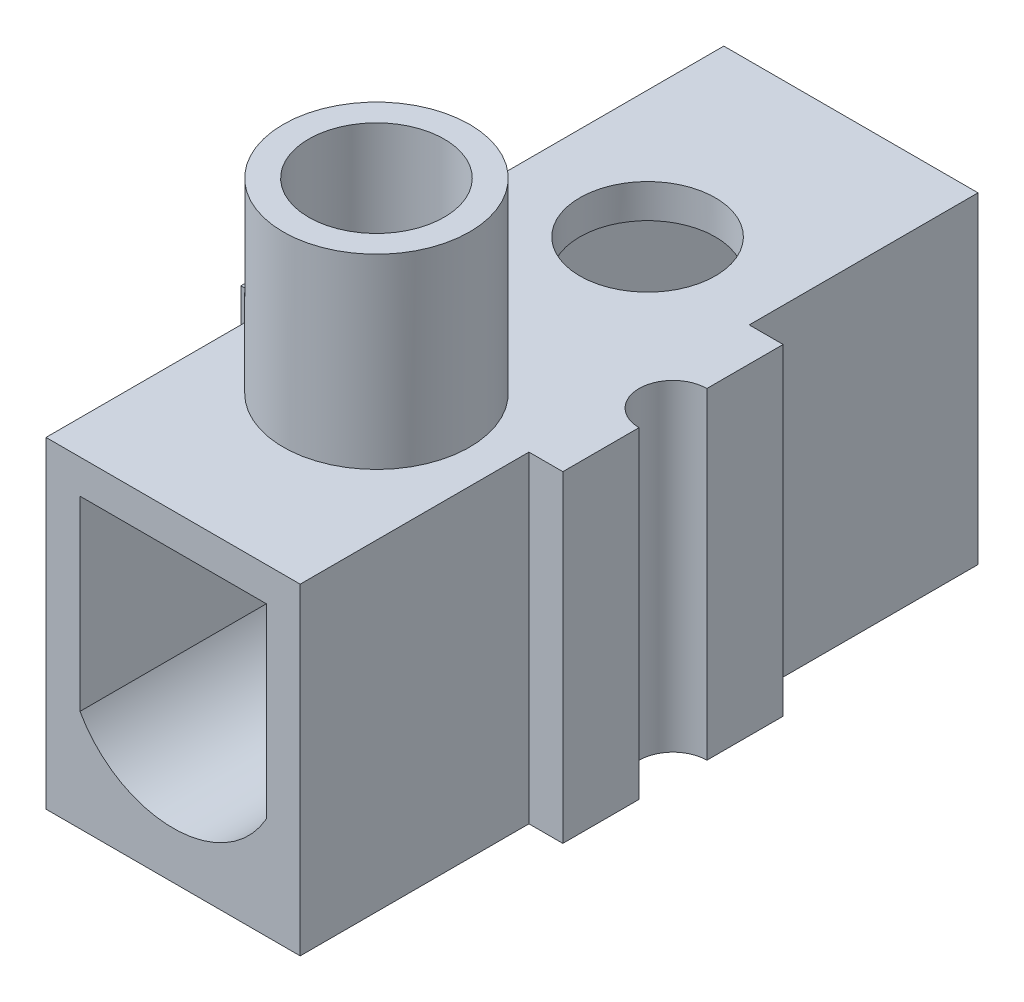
from build123d import *

# Parameters (mm, degrees)
ESQUISSE1_W             = 7.5
ESQUISSE1_H             = 9.5
EXTRUSION1_DEPTH        = 10
ESQUISSE2_W             = 6.5
ESQUISSE2_H             = 9.5
EXTRUSION2_DEPTH        = 1
ENL_V_MAT_EXTRU_1_DEPTH = 15.588094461
ESQUISSE4_R             = 2
ENL_V_MAT_EXTRU_2_DEPTH = 3
EXTRUSION3_START        = 5.5
ESQUISSE5_R             = 2.75
ESQUISSE5_R_2           = 2
EXTRUSION3_DEPTH        = 5.5


with BuildPart() as part:
    # Esquisse1 → Extrusion1 (new, symmetric)
    with BuildSketch(Plane.XY):
        with Locations((0, -4.75)):
            Rectangle(ESQUISSE1_W, ESQUISSE1_H)
        with BuildLine():
            Line((-2.747406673, -1), (2.75, -1))
            Line((2.75, -1), (2.75, -6.5))
            ThreePointArc((2.75, -6.5), (0.001296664, -8.111451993), (-2.747406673, -6.5))
            Line((-2.747406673, -6.5), (-2.747406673, -1))
        make_face(mode=Mode.SUBTRACT)
    extrude(amount=EXTRUSION1_DEPTH, both=True)

    # Esquisse2 → Extrusion2 (add)
    with BuildSketch(Plane(origin=(3.75, 0, 0), x_dir=(0, 0, -1), z_dir=(1, 0, 0))):
        with Locations((0, -4.75)):
            Rectangle(ESQUISSE2_W, ESQUISSE2_H)
    extrusion2 = extrude(amount=EXTRUSION2_DEPTH)

    # Sym_trie1: Extrusion2 across plane
    add(extrusion2.mirror(Plane(origin=(0, 0, 0), x_dir=(0, 0, 1), z_dir=(1, 0, 0))))

    # Esquisse3 → Enl_v. mat.-Extru.1 (cut, through all)
    with BuildSketch(Plane(origin=(0, 0, 0), x_dir=(-1, 0, 0), z_dir=(0, 1, 0))):
        with BuildLine():
            Line((-4.75, 1), (-4.75, -1))
            ThreePointArc((-4.75, -1), (-3.75, 0), (-4.75, 1))
        make_face()
        with BuildLine():
            Line((4.75, 1), (4.75, -1))
            ThreePointArc((4.75, -1), (3.75, 0), (4.75, 1))
        make_face()
    extrude(amount=-ENL_V_MAT_EXTRU_1_DEPTH, mode=Mode.SUBTRACT)

    # Esquisse4 → Enl_v. mat.-Extru.2 (cut)
    with BuildSketch(Plane(origin=(0, 0, 0), x_dir=(-1, 0, 0), z_dir=(0, 1, 0))):
        with Locations(Location((0, 4, 0), (0, 0, 90))):
            Circle(ESQUISSE4_R)
        with Locations(Location((0, -4, 0), (0, 0, 90))):
            Circle(ESQUISSE4_R)
    extrude(amount=-ENL_V_MAT_EXTRU_2_DEPTH, mode=Mode.SUBTRACT)

    # Esquisse5 → Extrusion3 (add)
    with BuildSketch(Plane(origin=(0, 0, 0), x_dir=(-1, 0, 0), z_dir=(0, 1, 0)).offset(EXTRUSION3_START)):
        with Locations(Location((0, 4, 0), (0, 0, 270))):
            Circle(ESQUISSE5_R)
        with Locations(Location((0, 4, 0), (0, 0, 90))):
            Circle(ESQUISSE5_R_2, mode=Mode.SUBTRACT)
    extrude(amount=-EXTRUSION3_DEPTH)


solid = part.part
